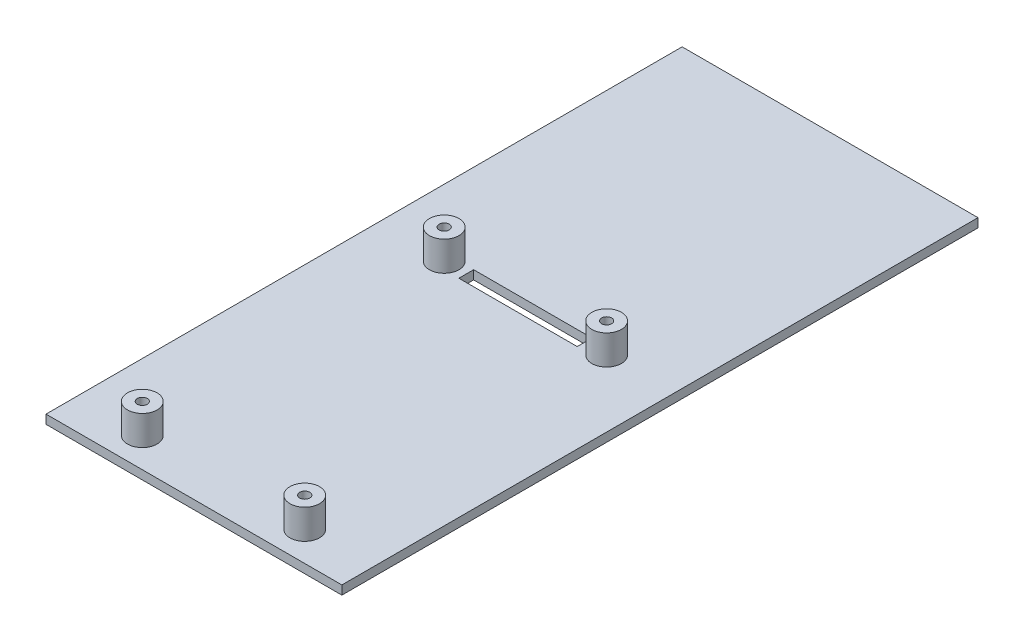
ISO-10303-21;
HEADER;
FILE_DESCRIPTION(('STEP AP214'),'2;1');
FILE_NAME('part.step','',(''),(''),'','','');
FILE_SCHEMA(('AUTOMOTIVE_DESIGN { 1 0 10303 214 1 1 1 1 }'));
ENDSEC;
DATA;
#1=APPLICATION_CONTEXT('core data for automotive mechanical design processes');
#2=APPLICATION_PROTOCOL_DEFINITION('international standard','automotive_design',2000,#1);
#3=PRODUCT_CONTEXT('',#1,'mechanical');
#4=PRODUCT('Part','Part','',(#3));
#5=PRODUCT_RELATED_PRODUCT_CATEGORY('part','',(#4));
#6=PRODUCT_DEFINITION_FORMATION('','',#4);
#7=PRODUCT_DEFINITION_CONTEXT('part definition',#1,'design');
#8=PRODUCT_DEFINITION('design','',#6,#7);
#9=PRODUCT_DEFINITION_SHAPE('','',#8);
#10=(LENGTH_UNIT() NAMED_UNIT(*) SI_UNIT(.MILLI.,.METRE.));
#11=(NAMED_UNIT(*) PLANE_ANGLE_UNIT() SI_UNIT($,.RADIAN.));
#12=(NAMED_UNIT(*) SI_UNIT($,.STERADIAN.) SOLID_ANGLE_UNIT());
#13=UNCERTAINTY_MEASURE_WITH_UNIT(LENGTH_MEASURE(1.E-05),#10,'distance_accuracy_value','');
#14=(GEOMETRIC_REPRESENTATION_CONTEXT(3) GLOBAL_UNCERTAINTY_ASSIGNED_CONTEXT((#13)) GLOBAL_UNIT_ASSIGNED_CONTEXT((#10,
#11,#12)) REPRESENTATION_CONTEXT('',''));
#15=CARTESIAN_POINT('',(0.,0.,0.));
#16=DIRECTION('',(0.,0.,1.));
#17=DIRECTION('',(1.,0.,0.));
#18=AXIS2_PLACEMENT_3D('',#15,#16,#17);
#19=CARTESIAN_POINT('',(50.,3.,-107.5));
#20=DIRECTION('',(-1.,0.,0.));
#21=DIRECTION('',(0.,0.,1.));
#22=AXIS2_PLACEMENT_3D('',#19,#20,#21);
#23=PLANE('',#22);
#24=DIRECTION('',(0.,0.,-1.));
#25=VECTOR('',#24,1.);
#26=CARTESIAN_POINT('',(50.,0.,-107.5));
#27=LINE('',#26,#25);
#28=CARTESIAN_POINT('',(50.,0.,107.5));
#29=VERTEX_POINT('',#28);
#30=CARTESIAN_POINT('',(50.,0.,-107.5));
#31=VERTEX_POINT('',#30);
#32=EDGE_CURVE('E182',#29,#31,#27,.T.);
#33=ORIENTED_EDGE('',*,*,#32,.T.);
#34=DIRECTION('',(0.,-1.,0.));
#35=VECTOR('',#34,1.);
#36=CARTESIAN_POINT('',(50.,3.,-107.5));
#37=LINE('',#36,#35);
#38=CARTESIAN_POINT('',(50.,3.,-107.5));
#39=VERTEX_POINT('',#38);
#40=EDGE_CURVE('E11',#39,#31,#37,.T.);
#41=ORIENTED_EDGE('',*,*,#40,.F.);
#42=DIRECTION('',(0.,0.,-1.));
#43=VECTOR('',#42,1.);
#44=CARTESIAN_POINT('',(50.,3.,-107.5));
#45=LINE('',#44,#43);
#46=CARTESIAN_POINT('',(50.,3.,107.5));
#47=VERTEX_POINT('',#46);
#48=EDGE_CURVE('E185',#47,#39,#45,.T.);
#49=ORIENTED_EDGE('',*,*,#48,.F.);
#50=DIRECTION('',(0.,-1.,0.));
#51=VECTOR('',#50,1.);
#52=CARTESIAN_POINT('',(50.,3.,107.5));
#53=LINE('',#52,#51);
#54=EDGE_CURVE('E195',#47,#29,#53,.T.);
#55=ORIENTED_EDGE('',*,*,#54,.T.);
#56=EDGE_LOOP('',(#33,#41,#49,#55));
#57=FACE_BOUND('',#56,.T.);
#58=ADVANCED_FACE('F36',(#57),#23,.F.);
#59=CARTESIAN_POINT('',(-50.,3.,-107.5));
#60=DIRECTION('',(0.,0.,1.));
#61=DIRECTION('',(1.,0.,0.));
#62=AXIS2_PLACEMENT_3D('',#59,#60,#61);
#63=PLANE('',#62);
#64=DIRECTION('',(-1.,0.,0.));
#65=VECTOR('',#64,1.);
#66=CARTESIAN_POINT('',(-50.,0.,-107.5));
#67=LINE('',#66,#65);
#68=CARTESIAN_POINT('',(-50.,0.,-107.5));
#69=VERTEX_POINT('',#68);
#70=EDGE_CURVE('E198',#31,#69,#67,.T.);
#71=ORIENTED_EDGE('',*,*,#70,.T.);
#72=DIRECTION('',(0.,-1.,0.));
#73=VECTOR('',#72,1.);
#74=CARTESIAN_POINT('',(-50.,3.,-107.5));
#75=LINE('',#74,#73);
#76=CARTESIAN_POINT('',(-50.,3.,-107.5));
#77=VERTEX_POINT('',#76);
#78=EDGE_CURVE('E43',#77,#69,#75,.T.);
#79=ORIENTED_EDGE('',*,*,#78,.F.);
#80=DIRECTION('',(-1.,0.,0.));
#81=VECTOR('',#80,1.);
#82=CARTESIAN_POINT('',(-50.,3.,-107.5));
#83=LINE('',#82,#81);
#84=EDGE_CURVE('E188',#39,#77,#83,.T.);
#85=ORIENTED_EDGE('',*,*,#84,.F.);
#86=ORIENTED_EDGE('',*,*,#40,.T.);
#87=EDGE_LOOP('',(#71,#79,#85,#86));
#88=FACE_BOUND('',#87,.T.);
#89=ADVANCED_FACE('F227',(#88),#63,.F.);
#90=CARTESIAN_POINT('',(-50.,3.,-107.5));
#91=DIRECTION('',(1.,0.,0.));
#92=DIRECTION('',(0.,0.,-1.));
#93=AXIS2_PLACEMENT_3D('',#90,#91,#92);
#94=PLANE('',#93);
#95=DIRECTION('',(0.,0.,1.));
#96=VECTOR('',#95,1.);
#97=CARTESIAN_POINT('',(-50.,0.,-107.5));
#98=LINE('',#97,#96);
#99=CARTESIAN_POINT('',(-50.,0.,107.5));
#100=VERTEX_POINT('',#99);
#101=EDGE_CURVE('E200',#69,#100,#98,.T.);
#102=ORIENTED_EDGE('',*,*,#101,.T.);
#103=DIRECTION('',(0.,-1.,0.));
#104=VECTOR('',#103,1.);
#105=CARTESIAN_POINT('',(-50.,3.,107.5));
#106=LINE('',#105,#104);
#107=CARTESIAN_POINT('',(-50.,3.,107.5));
#108=VERTEX_POINT('',#107);
#109=EDGE_CURVE('E205',#108,#100,#106,.T.);
#110=ORIENTED_EDGE('',*,*,#109,.F.);
#111=DIRECTION('',(0.,0.,1.));
#112=VECTOR('',#111,1.);
#113=CARTESIAN_POINT('',(-50.,3.,-107.5));
#114=LINE('',#113,#112);
#115=EDGE_CURVE('E191',#77,#108,#114,.T.);
#116=ORIENTED_EDGE('',*,*,#115,.F.);
#117=ORIENTED_EDGE('',*,*,#78,.T.);
#118=EDGE_LOOP('',(#102,#110,#116,#117));
#119=FACE_BOUND('',#118,.T.);
#120=ADVANCED_FACE('F212',(#119),#94,.F.);
#121=CARTESIAN_POINT('',(-50.,3.,107.5));
#122=DIRECTION('',(0.,0.,-1.));
#123=DIRECTION('',(-1.,0.,0.));
#124=AXIS2_PLACEMENT_3D('',#121,#122,#123);
#125=PLANE('',#124);
#126=DIRECTION('',(1.,0.,0.));
#127=VECTOR('',#126,1.);
#128=CARTESIAN_POINT('',(-50.,0.,107.5));
#129=LINE('',#128,#127);
#130=EDGE_CURVE('E189',#100,#29,#129,.T.);
#131=ORIENTED_EDGE('',*,*,#130,.T.);
#132=ORIENTED_EDGE('',*,*,#54,.F.);
#133=DIRECTION('',(1.,0.,0.));
#134=VECTOR('',#133,1.);
#135=CARTESIAN_POINT('',(-50.,3.,107.5));
#136=LINE('',#135,#134);
#137=EDGE_CURVE('E193',#108,#47,#136,.T.);
#138=ORIENTED_EDGE('',*,*,#137,.F.);
#139=ORIENTED_EDGE('',*,*,#109,.T.);
#140=EDGE_LOOP('',(#131,#132,#138,#139));
#141=FACE_BOUND('',#140,.T.);
#142=ADVANCED_FACE('F220',(#141),#125,.F.);
#143=CARTESIAN_POINT('',(0.,3.,0.));
#144=DIRECTION('',(0.,1.,0.));
#145=DIRECTION('',(0.,0.,1.));
#146=AXIS2_PLACEMENT_3D('',#143,#144,#145);
#147=PLANE('',#146);
#148=DIRECTION('',(0.,0.,-1.));
#149=VECTOR('',#148,1.);
#150=CARTESIAN_POINT('',(20.,3.,-7.04000000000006));
#151=LINE('',#150,#149);
#152=CARTESIAN_POINT('',(20.,3.,-2.04000000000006));
#153=VERTEX_POINT('',#152);
#154=CARTESIAN_POINT('',(20.,3.,-7.04000000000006));
#155=VERTEX_POINT('',#154);
#156=EDGE_CURVE('E50',#153,#155,#151,.T.);
#157=ORIENTED_EDGE('',*,*,#156,.F.);
#158=DIRECTION('',(1.,0.,0.));
#159=VECTOR('',#158,1.);
#160=CARTESIAN_POINT('',(-20.,3.,-2.04000000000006));
#161=LINE('',#160,#159);
#162=CARTESIAN_POINT('',(-20.,3.,-2.04000000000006));
#163=VERTEX_POINT('',#162);
#164=EDGE_CURVE('E118',#163,#153,#161,.T.);
#165=ORIENTED_EDGE('',*,*,#164,.F.);
#166=DIRECTION('',(0.,0.,1.));
#167=VECTOR('',#166,1.);
#168=CARTESIAN_POINT('',(-20.,3.,-7.04000000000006));
#169=LINE('',#168,#167);
#170=CARTESIAN_POINT('',(-20.,3.,-7.04000000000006));
#171=VERTEX_POINT('',#170);
#172=EDGE_CURVE('E121',#171,#163,#169,.T.);
#173=ORIENTED_EDGE('',*,*,#172,.F.);
#174=DIRECTION('',(-1.,0.,0.));
#175=VECTOR('',#174,1.);
#176=CARTESIAN_POINT('',(-20.,3.,-7.04000000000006));
#177=LINE('',#176,#175);
#178=EDGE_CURVE('E127',#155,#171,#177,.T.);
#179=ORIENTED_EDGE('',*,*,#178,.F.);
#180=EDGE_LOOP('',(#157,#165,#173,#179));
#181=FACE_BOUND('',#180,.T.);
#182=CARTESIAN_POINT('',(27.45,3.,97.5));
#183=DIRECTION('',(0.,1.,0.));
#184=DIRECTION('',(0.,0.,1.));
#185=AXIS2_PLACEMENT_3D('',#182,#183,#184);
#186=CIRCLE('',#185,5.);
#187=CARTESIAN_POINT('',(27.45,3.,102.5));
#188=VERTEX_POINT('',#187);
#189=EDGE_CURVE('E161',#188,#188,#186,.T.);
#190=ORIENTED_EDGE('',*,*,#189,.F.);
#191=EDGE_LOOP('',(#190));
#192=FACE_BOUND('',#191,.T.);
#193=CARTESIAN_POINT('',(27.45,3.,-4.54000000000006));
#194=DIRECTION('',(0.,1.,0.));
#195=DIRECTION('',(0.,0.,1.));
#196=AXIS2_PLACEMENT_3D('',#193,#194,#195);
#197=CIRCLE('',#196,5.);
#198=CARTESIAN_POINT('',(27.45,3.,0.45999999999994));
#199=VERTEX_POINT('',#198);
#200=EDGE_CURVE('E167',#199,#199,#197,.T.);
#201=ORIENTED_EDGE('',*,*,#200,.F.);
#202=EDGE_LOOP('',(#201));
#203=FACE_BOUND('',#202,.T.);
#204=CARTESIAN_POINT('',(-27.45,3.,97.5));
#205=DIRECTION('',(0.,1.,0.));
#206=DIRECTION('',(0.,0.,1.));
#207=AXIS2_PLACEMENT_3D('',#204,#205,#206);
#208=CIRCLE('',#207,5.);
#209=CARTESIAN_POINT('',(-27.45,3.,102.5));
#210=VERTEX_POINT('',#209);
#211=EDGE_CURVE('E173',#210,#210,#208,.T.);
#212=ORIENTED_EDGE('',*,*,#211,.F.);
#213=EDGE_LOOP('',(#212));
#214=FACE_BOUND('',#213,.T.);
#215=CARTESIAN_POINT('',(-27.45,3.,-4.54000000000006));
#216=DIRECTION('',(0.,1.,0.));
#217=DIRECTION('',(0.,0.,1.));
#218=AXIS2_PLACEMENT_3D('',#215,#216,#217);
#219=CIRCLE('',#218,5.);
#220=CARTESIAN_POINT('',(-27.45,3.,0.459999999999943));
#221=VERTEX_POINT('',#220);
#222=EDGE_CURVE('E176',#221,#221,#219,.T.);
#223=ORIENTED_EDGE('',*,*,#222,.F.);
#224=EDGE_LOOP('',(#223));
#225=FACE_BOUND('',#224,.T.);
#226=ORIENTED_EDGE('',*,*,#48,.T.);
#227=ORIENTED_EDGE('',*,*,#84,.T.);
#228=ORIENTED_EDGE('',*,*,#115,.T.);
#229=ORIENTED_EDGE('',*,*,#137,.T.);
#230=EDGE_LOOP('',(#226,#227,#228,#229));
#231=FACE_BOUND('',#230,.T.);
#232=ADVANCED_FACE('F226',(#181,#192,#203,#214,#225,#231),#147,.T.);
#233=CARTESIAN_POINT('',(0.,0.,0.));
#234=DIRECTION('',(0.,1.,0.));
#235=DIRECTION('',(0.,0.,1.));
#236=AXIS2_PLACEMENT_3D('',#233,#234,#235);
#237=PLANE('',#236);
#238=DIRECTION('',(1.,0.,0.));
#239=VECTOR('',#238,1.);
#240=CARTESIAN_POINT('',(-20.,0.,-2.04000000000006));
#241=LINE('',#240,#239);
#242=CARTESIAN_POINT('',(-20.,0.,-2.04000000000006));
#243=VERTEX_POINT('',#242);
#244=CARTESIAN_POINT('',(20.,0.,-2.04000000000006));
#245=VERTEX_POINT('',#244);
#246=EDGE_CURVE('E108',#243,#245,#241,.T.);
#247=ORIENTED_EDGE('',*,*,#246,.T.);
#248=DIRECTION('',(0.,0.,-1.));
#249=VECTOR('',#248,1.);
#250=CARTESIAN_POINT('',(20.,0.,-7.04000000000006));
#251=LINE('',#250,#249);
#252=CARTESIAN_POINT('',(20.,0.,-7.04000000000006));
#253=VERTEX_POINT('',#252);
#254=EDGE_CURVE('E102',#245,#253,#251,.T.);
#255=ORIENTED_EDGE('',*,*,#254,.T.);
#256=DIRECTION('',(-1.,0.,0.));
#257=VECTOR('',#256,1.);
#258=CARTESIAN_POINT('',(-20.,0.,-7.04000000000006));
#259=LINE('',#258,#257);
#260=CARTESIAN_POINT('',(-20.,0.,-7.04000000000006));
#261=VERTEX_POINT('',#260);
#262=EDGE_CURVE('E111',#253,#261,#259,.T.);
#263=ORIENTED_EDGE('',*,*,#262,.T.);
#264=DIRECTION('',(0.,0.,1.));
#265=VECTOR('',#264,1.);
#266=CARTESIAN_POINT('',(-20.,0.,-7.04000000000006));
#267=LINE('',#266,#265);
#268=EDGE_CURVE('E58',#261,#243,#267,.T.);
#269=ORIENTED_EDGE('',*,*,#268,.T.);
#270=EDGE_LOOP('',(#247,#255,#263,#269));
#271=FACE_BOUND('',#270,.T.);
#272=CARTESIAN_POINT('',(-27.45,0.,-4.54000000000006));
#273=DIRECTION('',(0.,1.,0.));
#274=DIRECTION('',(0.,0.,1.));
#275=AXIS2_PLACEMENT_3D('',#272,#273,#274);
#276=CIRCLE('',#275,1.7);
#277=CARTESIAN_POINT('',(-27.45,0.,-2.84000000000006));
#278=VERTEX_POINT('',#277);
#279=EDGE_CURVE('E139',#278,#278,#276,.T.);
#280=ORIENTED_EDGE('',*,*,#279,.T.);
#281=EDGE_LOOP('',(#280));
#282=FACE_BOUND('',#281,.T.);
#283=CARTESIAN_POINT('',(-27.45,0.,97.5));
#284=DIRECTION('',(0.,1.,0.));
#285=DIRECTION('',(0.,0.,1.));
#286=AXIS2_PLACEMENT_3D('',#283,#284,#285);
#287=CIRCLE('',#286,1.7);
#288=CARTESIAN_POINT('',(-27.45,0.,99.2));
#289=VERTEX_POINT('',#288);
#290=EDGE_CURVE('E145',#289,#289,#287,.T.);
#291=ORIENTED_EDGE('',*,*,#290,.T.);
#292=EDGE_LOOP('',(#291));
#293=FACE_BOUND('',#292,.T.);
#294=CARTESIAN_POINT('',(27.45,0.,97.4999999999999));
#295=DIRECTION('',(0.,1.,0.));
#296=DIRECTION('',(0.,0.,1.));
#297=AXIS2_PLACEMENT_3D('',#294,#295,#296);
#298=CIRCLE('',#297,1.7);
#299=CARTESIAN_POINT('',(27.45,0.,99.1999999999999));
#300=VERTEX_POINT('',#299);
#301=EDGE_CURVE('E151',#300,#300,#298,.T.);
#302=ORIENTED_EDGE('',*,*,#301,.T.);
#303=EDGE_LOOP('',(#302));
#304=FACE_BOUND('',#303,.T.);
#305=CARTESIAN_POINT('',(27.45,0.,-4.54000000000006));
#306=DIRECTION('',(0.,1.,0.));
#307=DIRECTION('',(0.,0.,1.));
#308=AXIS2_PLACEMENT_3D('',#305,#306,#307);
#309=CIRCLE('',#308,1.7);
#310=CARTESIAN_POINT('',(27.45,0.,-2.84000000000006));
#311=VERTEX_POINT('',#310);
#312=EDGE_CURVE('E157',#311,#311,#309,.T.);
#313=ORIENTED_EDGE('',*,*,#312,.T.);
#314=EDGE_LOOP('',(#313));
#315=FACE_BOUND('',#314,.T.);
#316=ORIENTED_EDGE('',*,*,#32,.F.);
#317=ORIENTED_EDGE('',*,*,#130,.F.);
#318=ORIENTED_EDGE('',*,*,#101,.F.);
#319=ORIENTED_EDGE('',*,*,#70,.F.);
#320=EDGE_LOOP('',(#316,#317,#318,#319));
#321=FACE_BOUND('',#320,.T.);
#322=ADVANCED_FACE('F115',(#271,#282,#293,#304,#315,#321),#237,.F.);
#323=CARTESIAN_POINT('',(-27.45,13.,-4.54000000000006));
#324=DIRECTION('',(0.,-1.,0.));
#325=DIRECTION('',(0.,0.,-1.));
#326=AXIS2_PLACEMENT_3D('',#323,#324,#325);
#327=CYLINDRICAL_SURFACE('',#326,5.);
#328=CARTESIAN_POINT('',(-27.45,13.,-4.54000000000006));
#329=DIRECTION('',(0.,1.,0.));
#330=DIRECTION('',(0.,0.,1.));
#331=AXIS2_PLACEMENT_3D('',#328,#329,#330);
#332=CIRCLE('',#331,5.);
#333=CARTESIAN_POINT('',(-27.45,13.,0.459999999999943));
#334=VERTEX_POINT('',#333);
#335=EDGE_CURVE('E179',#334,#334,#332,.T.);
#336=ORIENTED_EDGE('',*,*,#335,.F.);
#337=EDGE_LOOP('',(#336));
#338=FACE_BOUND('',#337,.T.);
#339=ORIENTED_EDGE('',*,*,#222,.T.);
#340=EDGE_LOOP('',(#339));
#341=FACE_BOUND('',#340,.T.);
#342=ADVANCED_FACE('F239',(#338,#341),#327,.T.);
#343=CARTESIAN_POINT('',(-27.45,13.,-4.54000000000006));
#344=DIRECTION('',(0.,1.,0.));
#345=DIRECTION('',(0.,0.,1.));
#346=AXIS2_PLACEMENT_3D('',#343,#344,#345);
#347=PLANE('',#346);
#348=CARTESIAN_POINT('',(-27.45,13.,-4.54000000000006));
#349=DIRECTION('',(0.,1.,0.));
#350=DIRECTION('',(0.,0.,1.));
#351=AXIS2_PLACEMENT_3D('',#348,#349,#350);
#352=CIRCLE('',#351,1.69999999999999);
#353=CARTESIAN_POINT('',(-27.45,13.,-2.84000000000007));
#354=VERTEX_POINT('',#353);
#355=EDGE_CURVE('E133',#354,#354,#352,.T.);
#356=ORIENTED_EDGE('',*,*,#355,.F.);
#357=EDGE_LOOP('',(#356));
#358=FACE_BOUND('',#357,.T.);
#359=ORIENTED_EDGE('',*,*,#335,.T.);
#360=EDGE_LOOP('',(#359));
#361=FACE_BOUND('',#360,.T.);
#362=ADVANCED_FACE('F245',(#358,#361),#347,.T.);
#363=CARTESIAN_POINT('',(-27.45,13.,97.5));
#364=DIRECTION('',(0.,-1.,0.));
#365=DIRECTION('',(0.,0.,-1.));
#366=AXIS2_PLACEMENT_3D('',#363,#364,#365);
#367=CYLINDRICAL_SURFACE('',#366,5.);
#368=CARTESIAN_POINT('',(-27.45,13.,97.5));
#369=DIRECTION('',(0.,1.,0.));
#370=DIRECTION('',(0.,0.,1.));
#371=AXIS2_PLACEMENT_3D('',#368,#369,#370);
#372=CIRCLE('',#371,5.);
#373=CARTESIAN_POINT('',(-27.45,13.,102.5));
#374=VERTEX_POINT('',#373);
#375=EDGE_CURVE('E170',#374,#374,#372,.T.);
#376=ORIENTED_EDGE('',*,*,#375,.F.);
#377=EDGE_LOOP('',(#376));
#378=FACE_BOUND('',#377,.T.);
#379=ORIENTED_EDGE('',*,*,#211,.T.);
#380=EDGE_LOOP('',(#379));
#381=FACE_BOUND('',#380,.T.);
#382=ADVANCED_FACE('F249',(#378,#381),#367,.T.);
#383=CARTESIAN_POINT('',(-27.45,13.,97.5));
#384=DIRECTION('',(0.,1.,0.));
#385=DIRECTION('',(0.,0.,1.));
#386=AXIS2_PLACEMENT_3D('',#383,#384,#385);
#387=PLANE('',#386);
#388=CARTESIAN_POINT('',(-27.45,13.,97.5));
#389=DIRECTION('',(0.,1.,0.));
#390=DIRECTION('',(0.,0.,1.));
#391=AXIS2_PLACEMENT_3D('',#388,#389,#390);
#392=CIRCLE('',#391,1.69999999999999);
#393=CARTESIAN_POINT('',(-27.45,13.,99.2));
#394=VERTEX_POINT('',#393);
#395=EDGE_CURVE('E142',#394,#394,#392,.T.);
#396=ORIENTED_EDGE('',*,*,#395,.F.);
#397=EDGE_LOOP('',(#396));
#398=FACE_BOUND('',#397,.T.);
#399=ORIENTED_EDGE('',*,*,#375,.T.);
#400=EDGE_LOOP('',(#399));
#401=FACE_BOUND('',#400,.T.);
#402=ADVANCED_FACE('F251',(#398,#401),#387,.T.);
#403=CARTESIAN_POINT('',(27.45,13.,-4.54000000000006));
#404=DIRECTION('',(0.,-1.,0.));
#405=DIRECTION('',(0.,0.,-1.));
#406=AXIS2_PLACEMENT_3D('',#403,#404,#405);
#407=CYLINDRICAL_SURFACE('',#406,5.);
#408=CARTESIAN_POINT('',(27.45,13.,-4.54000000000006));
#409=DIRECTION('',(0.,1.,0.));
#410=DIRECTION('',(0.,0.,1.));
#411=AXIS2_PLACEMENT_3D('',#408,#409,#410);
#412=CIRCLE('',#411,5.);
#413=CARTESIAN_POINT('',(27.45,13.,0.45999999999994));
#414=VERTEX_POINT('',#413);
#415=EDGE_CURVE('E164',#414,#414,#412,.T.);
#416=ORIENTED_EDGE('',*,*,#415,.F.);
#417=EDGE_LOOP('',(#416));
#418=FACE_BOUND('',#417,.T.);
#419=ORIENTED_EDGE('',*,*,#200,.T.);
#420=EDGE_LOOP('',(#419));
#421=FACE_BOUND('',#420,.T.);
#422=ADVANCED_FACE('F254',(#418,#421),#407,.T.);
#423=CARTESIAN_POINT('',(27.45,13.,-4.54000000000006));
#424=DIRECTION('',(0.,1.,0.));
#425=DIRECTION('',(0.,0.,1.));
#426=AXIS2_PLACEMENT_3D('',#423,#424,#425);
#427=PLANE('',#426);
#428=CARTESIAN_POINT('',(27.45,13.,-4.54000000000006));
#429=DIRECTION('',(0.,1.,0.));
#430=DIRECTION('',(0.,0.,1.));
#431=AXIS2_PLACEMENT_3D('',#428,#429,#430);
#432=CIRCLE('',#431,1.69999999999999);
#433=CARTESIAN_POINT('',(27.45,13.,-2.84000000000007));
#434=VERTEX_POINT('',#433);
#435=EDGE_CURVE('E154',#434,#434,#432,.T.);
#436=ORIENTED_EDGE('',*,*,#435,.F.);
#437=EDGE_LOOP('',(#436));
#438=FACE_BOUND('',#437,.T.);
#439=ORIENTED_EDGE('',*,*,#415,.T.);
#440=EDGE_LOOP('',(#439));
#441=FACE_BOUND('',#440,.T.);
#442=ADVANCED_FACE('F259',(#438,#441),#427,.T.);
#443=CARTESIAN_POINT('',(27.45,13.,97.5));
#444=DIRECTION('',(0.,-1.,0.));
#445=DIRECTION('',(0.,0.,-1.));
#446=AXIS2_PLACEMENT_3D('',#443,#444,#445);
#447=CYLINDRICAL_SURFACE('',#446,5.);
#448=CARTESIAN_POINT('',(27.45,13.,97.5));
#449=DIRECTION('',(0.,1.,0.));
#450=DIRECTION('',(0.,0.,1.));
#451=AXIS2_PLACEMENT_3D('',#448,#449,#450);
#452=CIRCLE('',#451,5.);
#453=CARTESIAN_POINT('',(27.45,13.,102.5));
#454=VERTEX_POINT('',#453);
#455=EDGE_CURVE('E160',#454,#454,#452,.T.);
#456=ORIENTED_EDGE('',*,*,#455,.F.);
#457=EDGE_LOOP('',(#456));
#458=FACE_BOUND('',#457,.T.);
#459=ORIENTED_EDGE('',*,*,#189,.T.);
#460=EDGE_LOOP('',(#459));
#461=FACE_BOUND('',#460,.T.);
#462=ADVANCED_FACE('F262',(#458,#461),#447,.T.);
#463=CARTESIAN_POINT('',(27.45,13.,97.5));
#464=DIRECTION('',(0.,1.,0.));
#465=DIRECTION('',(0.,0.,1.));
#466=AXIS2_PLACEMENT_3D('',#463,#464,#465);
#467=PLANE('',#466);
#468=CARTESIAN_POINT('',(27.45,13.,97.4999999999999));
#469=DIRECTION('',(0.,1.,0.));
#470=DIRECTION('',(0.,0.,1.));
#471=AXIS2_PLACEMENT_3D('',#468,#469,#470);
#472=CIRCLE('',#471,1.69999999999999);
#473=CARTESIAN_POINT('',(27.45,13.,99.1999999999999));
#474=VERTEX_POINT('',#473);
#475=EDGE_CURVE('E148',#474,#474,#472,.T.);
#476=ORIENTED_EDGE('',*,*,#475,.F.);
#477=EDGE_LOOP('',(#476));
#478=FACE_BOUND('',#477,.T.);
#479=ORIENTED_EDGE('',*,*,#455,.T.);
#480=EDGE_LOOP('',(#479));
#481=FACE_BOUND('',#480,.T.);
#482=ADVANCED_FACE('F267',(#478,#481),#467,.T.);
#483=CARTESIAN_POINT('',(27.45,13.,-4.54000000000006));
#484=DIRECTION('',(0.,1.,0.));
#485=DIRECTION('',(0.,0.,1.));
#486=AXIS2_PLACEMENT_3D('',#483,#484,#485);
#487=CYLINDRICAL_SURFACE('',#486,1.69999999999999);
#488=ORIENTED_EDGE('',*,*,#312,.F.);
#489=EDGE_LOOP('',(#488));
#490=FACE_BOUND('',#489,.T.);
#491=ORIENTED_EDGE('',*,*,#435,.T.);
#492=EDGE_LOOP('',(#491));
#493=FACE_BOUND('',#492,.T.);
#494=ADVANCED_FACE('F270',(#490,#493),#487,.F.);
#495=CARTESIAN_POINT('',(27.45,13.,97.4999999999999));
#496=DIRECTION('',(0.,1.,0.));
#497=DIRECTION('',(0.,0.,1.));
#498=AXIS2_PLACEMENT_3D('',#495,#496,#497);
#499=CYLINDRICAL_SURFACE('',#498,1.69999999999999);
#500=ORIENTED_EDGE('',*,*,#301,.F.);
#501=EDGE_LOOP('',(#500));
#502=FACE_BOUND('',#501,.T.);
#503=ORIENTED_EDGE('',*,*,#475,.T.);
#504=EDGE_LOOP('',(#503));
#505=FACE_BOUND('',#504,.T.);
#506=ADVANCED_FACE('F277',(#502,#505),#499,.F.);
#507=CARTESIAN_POINT('',(-27.45,13.,97.5));
#508=DIRECTION('',(0.,1.,0.));
#509=DIRECTION('',(0.,0.,1.));
#510=AXIS2_PLACEMENT_3D('',#507,#508,#509);
#511=CYLINDRICAL_SURFACE('',#510,1.69999999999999);
#512=ORIENTED_EDGE('',*,*,#290,.F.);
#513=EDGE_LOOP('',(#512));
#514=FACE_BOUND('',#513,.T.);
#515=ORIENTED_EDGE('',*,*,#395,.T.);
#516=EDGE_LOOP('',(#515));
#517=FACE_BOUND('',#516,.T.);
#518=ADVANCED_FACE('F281',(#514,#517),#511,.F.);
#519=CARTESIAN_POINT('',(-27.45,13.,-4.54000000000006));
#520=DIRECTION('',(0.,1.,0.));
#521=DIRECTION('',(0.,0.,1.));
#522=AXIS2_PLACEMENT_3D('',#519,#520,#521);
#523=CYLINDRICAL_SURFACE('',#522,1.69999999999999);
#524=ORIENTED_EDGE('',*,*,#279,.F.);
#525=EDGE_LOOP('',(#524));
#526=FACE_BOUND('',#525,.T.);
#527=ORIENTED_EDGE('',*,*,#355,.T.);
#528=EDGE_LOOP('',(#527));
#529=FACE_BOUND('',#528,.T.);
#530=ADVANCED_FACE('F285',(#526,#529),#523,.F.);
#531=CARTESIAN_POINT('',(20.,0.,-7.04000000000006));
#532=DIRECTION('',(1.,0.,0.));
#533=DIRECTION('',(0.,0.,-1.));
#534=AXIS2_PLACEMENT_3D('',#531,#532,#533);
#535=PLANE('',#534);
#536=ORIENTED_EDGE('',*,*,#156,.T.);
#537=DIRECTION('',(0.,1.,0.));
#538=VECTOR('',#537,1.);
#539=CARTESIAN_POINT('',(20.,0.,-7.04000000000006));
#540=LINE('',#539,#538);
#541=EDGE_CURVE('E98',#253,#155,#540,.T.);
#542=ORIENTED_EDGE('',*,*,#541,.F.);
#543=ORIENTED_EDGE('',*,*,#254,.F.);
#544=DIRECTION('',(0.,1.,0.));
#545=VECTOR('',#544,1.);
#546=CARTESIAN_POINT('',(20.,0.,-2.04000000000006));
#547=LINE('',#546,#545);
#548=EDGE_CURVE('E131',#245,#153,#547,.T.);
#549=ORIENTED_EDGE('',*,*,#548,.T.);
#550=EDGE_LOOP('',(#536,#542,#543,#549));
#551=FACE_BOUND('',#550,.T.);
#552=ADVANCED_FACE('F100',(#551),#535,.F.);
#553=CARTESIAN_POINT('',(-20.,0.,-2.04000000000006));
#554=DIRECTION('',(0.,0.,1.));
#555=DIRECTION('',(1.,0.,0.));
#556=AXIS2_PLACEMENT_3D('',#553,#554,#555);
#557=PLANE('',#556);
#558=ORIENTED_EDGE('',*,*,#164,.T.);
#559=ORIENTED_EDGE('',*,*,#548,.F.);
#560=ORIENTED_EDGE('',*,*,#246,.F.);
#561=DIRECTION('',(0.,1.,0.));
#562=VECTOR('',#561,1.);
#563=CARTESIAN_POINT('',(-20.,0.,-2.04000000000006));
#564=LINE('',#563,#562);
#565=EDGE_CURVE('E134',#243,#163,#564,.T.);
#566=ORIENTED_EDGE('',*,*,#565,.T.);
#567=EDGE_LOOP('',(#558,#559,#560,#566));
#568=FACE_BOUND('',#567,.T.);
#569=ADVANCED_FACE('F292',(#568),#557,.F.);
#570=CARTESIAN_POINT('',(-20.,0.,-7.04000000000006));
#571=DIRECTION('',(-1.,0.,0.));
#572=DIRECTION('',(0.,0.,1.));
#573=AXIS2_PLACEMENT_3D('',#570,#571,#572);
#574=PLANE('',#573);
#575=ORIENTED_EDGE('',*,*,#172,.T.);
#576=ORIENTED_EDGE('',*,*,#565,.F.);
#577=ORIENTED_EDGE('',*,*,#268,.F.);
#578=DIRECTION('',(0.,1.,0.));
#579=VECTOR('',#578,1.);
#580=CARTESIAN_POINT('',(-20.,0.,-7.04000000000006));
#581=LINE('',#580,#579);
#582=EDGE_CURVE('E107',#261,#171,#581,.T.);
#583=ORIENTED_EDGE('',*,*,#582,.T.);
#584=EDGE_LOOP('',(#575,#576,#577,#583));
#585=FACE_BOUND('',#584,.T.);
#586=ADVANCED_FACE('F295',(#585),#574,.F.);
#587=CARTESIAN_POINT('',(-20.,0.,-7.04000000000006));
#588=DIRECTION('',(0.,0.,-1.));
#589=DIRECTION('',(-1.,0.,0.));
#590=AXIS2_PLACEMENT_3D('',#587,#588,#589);
#591=PLANE('',#590);
#592=ORIENTED_EDGE('',*,*,#178,.T.);
#593=ORIENTED_EDGE('',*,*,#582,.F.);
#594=ORIENTED_EDGE('',*,*,#262,.F.);
#595=ORIENTED_EDGE('',*,*,#541,.T.);
#596=EDGE_LOOP('',(#592,#593,#594,#595));
#597=FACE_BOUND('',#596,.T.);
#598=ADVANCED_FACE('F112',(#597),#591,.F.);
#599=CLOSED_SHELL('',(#58,#89,#120,#142,#232,#322,#342,#362,#382,#402,#422,#442,#462,#482,#494,
#506,#518,#530,#552,#569,#586,#598));
#600=MANIFOLD_SOLID_BREP('B2',#599);
#601=ADVANCED_BREP_SHAPE_REPRESENTATION('',(#18,#600),#14);
#602=SHAPE_DEFINITION_REPRESENTATION(#9,#601);
ENDSEC;
END-ISO-10303-21;
